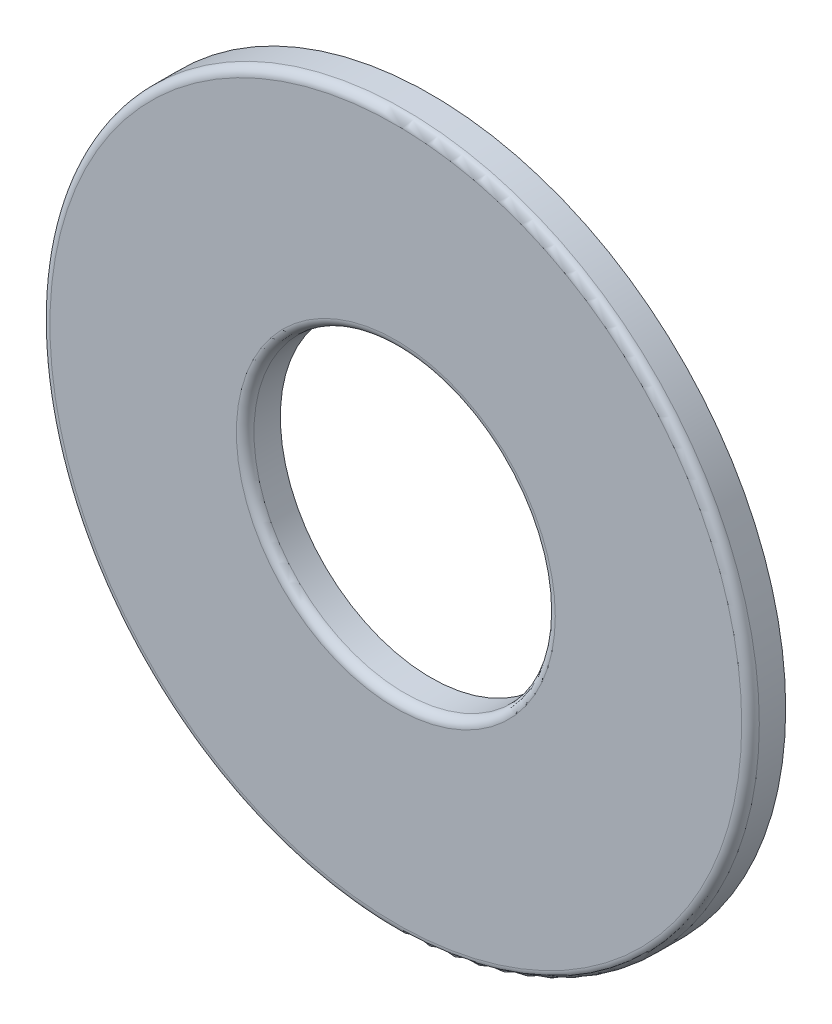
from build123d import *

# Parameters (mm, degrees)
BOSS_EXTRUDE1_DEPTH      = 0.7874
BOSS_EXTRUDE1_DEPTH_BACK = 0.7874
SKETCH3_R                = 15.875
SKETCH3_R_2              = 6.7437
FILLET1_R                = 0.3937


with BuildPart() as part:
    # Sketch3 → Boss-Extrude1 (new, two sides: drawn at the far end of the back side and taken through both)
    with BuildSketch(Plane.XY.offset(-BOSS_EXTRUDE1_DEPTH_BACK)):
        Circle(SKETCH3_R)
        Circle(SKETCH3_R_2, mode=Mode.SUBTRACT)
    extrude(amount=BOSS_EXTRUDE1_DEPTH + BOSS_EXTRUDE1_DEPTH_BACK)

    # Fillet1
    fillet1_edges = [part.edges().sort_by_distance(p)[0] for p in [
        (-15.875, 0, 0.7874),
        (-6.7437, 0, 0.7874),
    ]]
    fillet(fillet1_edges, radius=FILLET1_R)


solid = part.part
